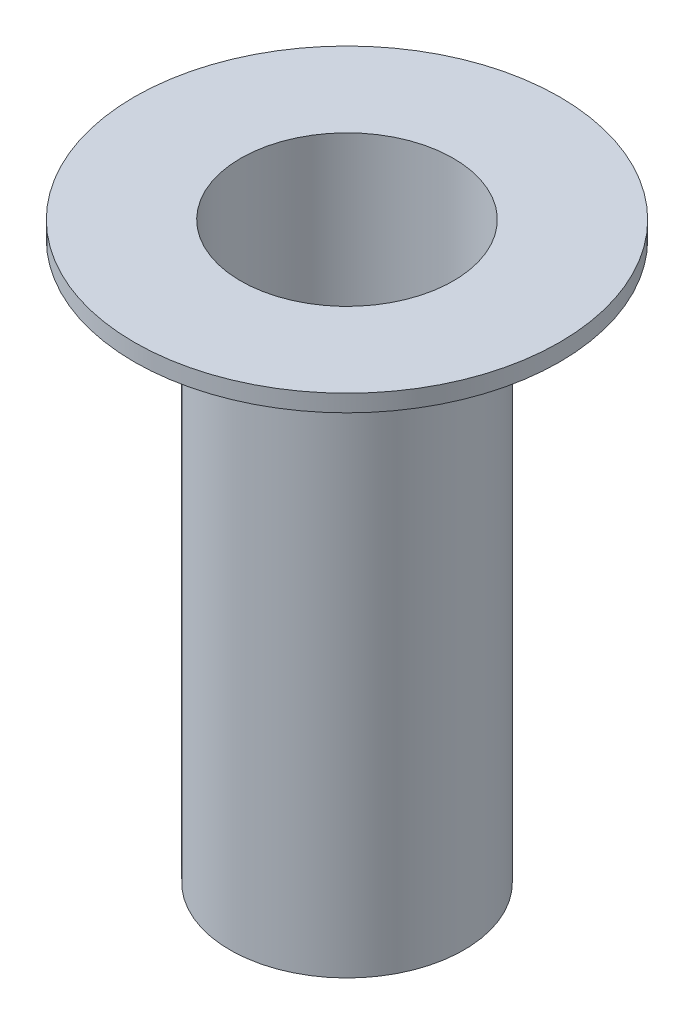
ISO-10303-21;
HEADER;
FILE_DESCRIPTION(('STEP AP214'),'2;1');
FILE_NAME('part.step','',(''),(''),'','','');
FILE_SCHEMA(('AUTOMOTIVE_DESIGN { 1 0 10303 214 1 1 1 1 }'));
ENDSEC;
DATA;
#1=APPLICATION_CONTEXT('core data for automotive mechanical design processes');
#2=APPLICATION_PROTOCOL_DEFINITION('international standard','automotive_design',2000,#1);
#3=PRODUCT_CONTEXT('',#1,'mechanical');
#4=PRODUCT('Part','Part','',(#3));
#5=PRODUCT_RELATED_PRODUCT_CATEGORY('part','',(#4));
#6=PRODUCT_DEFINITION_FORMATION('','',#4);
#7=PRODUCT_DEFINITION_CONTEXT('part definition',#1,'design');
#8=PRODUCT_DEFINITION('design','',#6,#7);
#9=PRODUCT_DEFINITION_SHAPE('','',#8);
#10=(LENGTH_UNIT() NAMED_UNIT(*) SI_UNIT(.MILLI.,.METRE.));
#11=(NAMED_UNIT(*) PLANE_ANGLE_UNIT() SI_UNIT($,.RADIAN.));
#12=(NAMED_UNIT(*) SI_UNIT($,.STERADIAN.) SOLID_ANGLE_UNIT());
#13=UNCERTAINTY_MEASURE_WITH_UNIT(LENGTH_MEASURE(1.E-05),#10,'distance_accuracy_value','');
#14=(GEOMETRIC_REPRESENTATION_CONTEXT(3) GLOBAL_UNCERTAINTY_ASSIGNED_CONTEXT((#13)) GLOBAL_UNIT_ASSIGNED_CONTEXT((#10,
#11,#12)) REPRESENTATION_CONTEXT('',''));
#15=CARTESIAN_POINT('',(0.,0.,0.));
#16=DIRECTION('',(0.,0.,1.));
#17=DIRECTION('',(1.,0.,0.));
#18=AXIS2_PLACEMENT_3D('',#15,#16,#17);
#19=CARTESIAN_POINT('',(228.908774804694,147.923400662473,0.));
#20=DIRECTION('',(0.,1.,0.));
#21=DIRECTION('',(0.,0.,1.));
#22=AXIS2_PLACEMENT_3D('',#19,#20,#21);
#23=PLANE('',#22);
#24=CARTESIAN_POINT('',(303.908774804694,147.923400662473,0.));
#25=DIRECTION('',(0.,1.,0.));
#26=DIRECTION('',(-1.,0.,0.));
#27=AXIS2_PLACEMENT_3D('',#24,#25,#26);
#28=CIRCLE('',#27,100.);
#29=CARTESIAN_POINT('',(203.908774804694,147.923400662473,0.));
#30=VERTEX_POINT('',#29);
#31=EDGE_CURVE('E17',#30,#30,#28,.F.);
#32=ORIENTED_EDGE('',*,*,#31,.F.);
#33=EDGE_LOOP('',(#32));
#34=FACE_BOUND('',#33,.T.);
#35=CARTESIAN_POINT('',(303.908774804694,147.923400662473,0.));
#36=DIRECTION('',(0.,1.,0.));
#37=DIRECTION('',(-1.,0.,0.));
#38=AXIS2_PLACEMENT_3D('',#35,#36,#37);
#39=CIRCLE('',#38,50.);
#40=CARTESIAN_POINT('',(253.908774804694,147.923400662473,0.));
#41=VERTEX_POINT('',#40);
#42=EDGE_CURVE('E33',#41,#41,#39,.T.);
#43=ORIENTED_EDGE('',*,*,#42,.F.);
#44=EDGE_LOOP('',(#43));
#45=FACE_BOUND('',#44,.T.);
#46=ADVANCED_FACE('F14',(#34,#45),#23,.T.);
#47=CARTESIAN_POINT('',(303.908774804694,143.923400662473,0.));
#48=DIRECTION('',(0.,1.,0.));
#49=DIRECTION('',(-1.,0.,0.));
#50=AXIS2_PLACEMENT_3D('',#47,#48,#49);
#51=CYLINDRICAL_SURFACE('',#50,100.);
#52=ORIENTED_EDGE('',*,*,#31,.T.);
#53=EDGE_LOOP('',(#52));
#54=FACE_BOUND('',#53,.T.);
#55=CARTESIAN_POINT('',(303.908774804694,139.923400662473,0.));
#56=DIRECTION('',(0.,1.,0.));
#57=DIRECTION('',(-1.,0.,0.));
#58=AXIS2_PLACEMENT_3D('',#55,#56,#57);
#59=CIRCLE('',#58,100.);
#60=CARTESIAN_POINT('',(203.908774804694,139.923400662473,0.));
#61=VERTEX_POINT('',#60);
#62=EDGE_CURVE('E31',#61,#61,#59,.F.);
#63=ORIENTED_EDGE('',*,*,#62,.F.);
#64=EDGE_LOOP('',(#63));
#65=FACE_BOUND('',#64,.T.);
#66=ADVANCED_FACE('F40',(#54,#65),#51,.T.);
#67=CARTESIAN_POINT('',(303.908774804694,-122.076599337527,0.));
#68=DIRECTION('',(0.,1.,0.));
#69=DIRECTION('',(-1.,0.,0.));
#70=AXIS2_PLACEMENT_3D('',#67,#68,#69);
#71=CYLINDRICAL_SURFACE('',#70,50.);
#72=CARTESIAN_POINT('',(303.908774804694,-122.076599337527,0.));
#73=DIRECTION('',(0.,1.,0.));
#74=DIRECTION('',(-1.,0.,0.));
#75=AXIS2_PLACEMENT_3D('',#72,#73,#74);
#76=CIRCLE('',#75,50.);
#77=CARTESIAN_POINT('',(253.908774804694,-122.076599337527,0.));
#78=VERTEX_POINT('',#77);
#79=EDGE_CURVE('E26',#78,#78,#76,.T.);
#80=ORIENTED_EDGE('',*,*,#79,.F.);
#81=EDGE_LOOP('',(#80));
#82=FACE_BOUND('',#81,.T.);
#83=ORIENTED_EDGE('',*,*,#42,.T.);
#84=EDGE_LOOP('',(#83));
#85=FACE_BOUND('',#84,.T.);
#86=ADVANCED_FACE('F49',(#82,#85),#71,.F.);
#87=CARTESIAN_POINT('',(226.408774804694,139.923400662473,0.));
#88=DIRECTION('',(0.,-1.,0.));
#89=DIRECTION('',(1.,0.,0.));
#90=AXIS2_PLACEMENT_3D('',#87,#88,#89);
#91=PLANE('',#90);
#92=CARTESIAN_POINT('',(303.908774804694,139.923400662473,0.));
#93=DIRECTION('',(0.,1.,0.));
#94=DIRECTION('',(-1.,0.,0.));
#95=AXIS2_PLACEMENT_3D('',#92,#93,#94);
#96=CIRCLE('',#95,55.);
#97=CARTESIAN_POINT('',(248.908774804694,139.923400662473,0.));
#98=VERTEX_POINT('',#97);
#99=EDGE_CURVE('E21',#98,#98,#96,.F.);
#100=ORIENTED_EDGE('',*,*,#99,.F.);
#101=EDGE_LOOP('',(#100));
#102=FACE_BOUND('',#101,.T.);
#103=ORIENTED_EDGE('',*,*,#62,.T.);
#104=EDGE_LOOP('',(#103));
#105=FACE_BOUND('',#104,.T.);
#106=ADVANCED_FACE('F58',(#102,#105),#91,.T.);
#107=CARTESIAN_POINT('',(251.408774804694,-122.076599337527,0.));
#108=DIRECTION('',(0.,-1.,0.));
#109=DIRECTION('',(1.,0.,0.));
#110=AXIS2_PLACEMENT_3D('',#107,#108,#109);
#111=PLANE('',#110);
#112=ORIENTED_EDGE('',*,*,#79,.T.);
#113=EDGE_LOOP('',(#112));
#114=FACE_BOUND('',#113,.T.);
#115=CARTESIAN_POINT('',(303.908774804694,-122.076599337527,0.));
#116=DIRECTION('',(0.,1.,0.));
#117=DIRECTION('',(-1.,0.,0.));
#118=AXIS2_PLACEMENT_3D('',#115,#116,#117);
#119=CIRCLE('',#118,55.);
#120=CARTESIAN_POINT('',(248.908774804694,-122.076599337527,0.));
#121=VERTEX_POINT('',#120);
#122=EDGE_CURVE('E9',#121,#121,#119,.T.);
#123=ORIENTED_EDGE('',*,*,#122,.F.);
#124=EDGE_LOOP('',(#123));
#125=FACE_BOUND('',#124,.T.);
#126=ADVANCED_FACE('F52',(#114,#125),#111,.T.);
#127=CARTESIAN_POINT('',(303.908774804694,8.92340066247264,0.));
#128=DIRECTION('',(0.,1.,0.));
#129=DIRECTION('',(-1.,0.,0.));
#130=AXIS2_PLACEMENT_3D('',#127,#128,#129);
#131=CYLINDRICAL_SURFACE('',#130,55.);
#132=ORIENTED_EDGE('',*,*,#99,.T.);
#133=EDGE_LOOP('',(#132));
#134=FACE_BOUND('',#133,.T.);
#135=ORIENTED_EDGE('',*,*,#122,.T.);
#136=EDGE_LOOP('',(#135));
#137=FACE_BOUND('',#136,.T.);
#138=ADVANCED_FACE('F50',(#134,#137),#131,.T.);
#139=CLOSED_SHELL('',(#46,#66,#86,#106,#126,#138));
#140=MANIFOLD_SOLID_BREP('B1',#139);
#141=ADVANCED_BREP_SHAPE_REPRESENTATION('',(#18,#140),#14);
#142=SHAPE_DEFINITION_REPRESENTATION(#9,#141);
ENDSEC;
END-ISO-10303-21;
